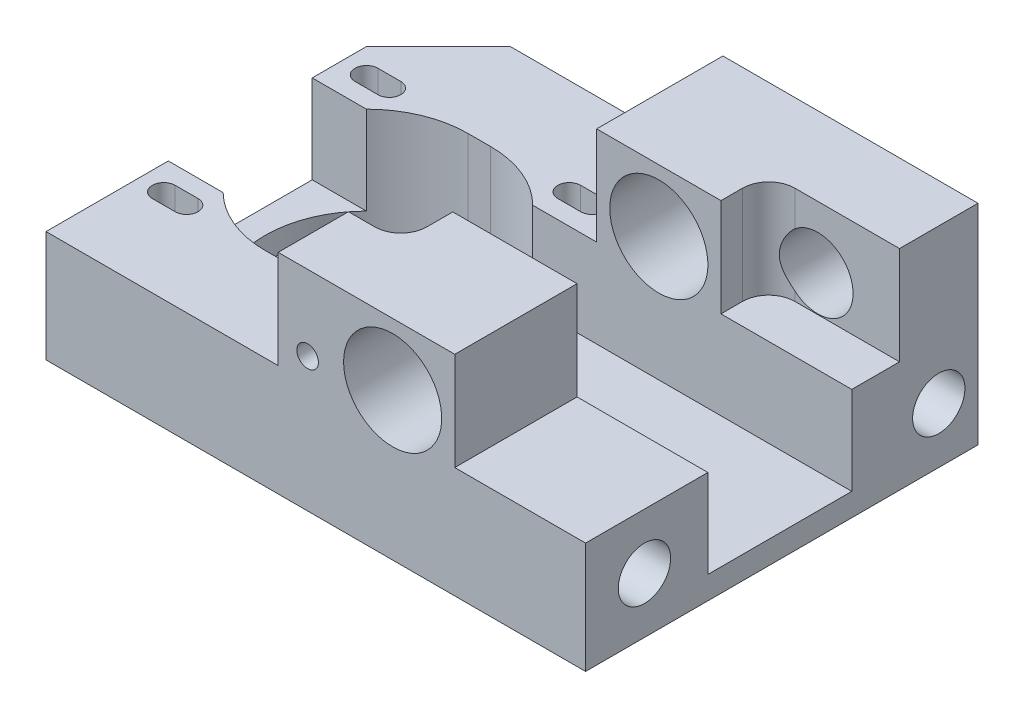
from build123d import *

# Parameters (mm, degrees)
BOSS_EXTRU_1_DEPTH             = 32
ENL_V_MAT_EXTRU_1_DEPTH        = 15
ESQUISSE3_R                    = 7.5
ENL_V_MAT_EXTRU_2_DEPTH        = 107.912347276
TROU_TARAUD_M12X1_251_D        = 10.8
TROU_TARAUD_M41_D              = 3.3
TROUS_DE_CENTRAGE_8_0MM1_D     = 8
TROUS_DE_CENTRAGE_8_0MM1_DEPTH = 39
TROUS_DE_CENTRAGE_8_0MM1_TIP   = 2.403442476
ESQUISSE10_W                   = 22
ESQUISSE10_H                   = 32.48548524
ENL_V_MAT_EXTRU_3_DEPTH        = 107.912347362


with BuildPart() as part:
    # Esquisse1 → Boss.-Extru.1 (new body)
    with BuildSketch(Plane(origin=(0, 0, 0), x_dir=(1, 0, 0), z_dir=(0, 1, 0))):
        Polygon((0, 0), (0, 49), (11, 60), (82.5, 60), (82.5, 0), align=None)
        with BuildLine():
            Line((34.75, 47), (38.25, 47))
            ThreePointArc((38.25, 47), (40, 45.25), (38.25, 43.5))
            Line((38.25, 43.5), (34.75, 43.5))
            ThreePointArc((34.75, 43.5), (33, 45.25), (34.75, 47))
        make_face(mode=Mode.SUBTRACT)
        with BuildLine():
            Line((3.75, 47), (7.25, 47))
            ThreePointArc((7.25, 47), (9, 45.25), (7.25, 43.5))
            Line((7.25, 43.5), (3.75, 43.5))
            ThreePointArc((3.75, 43.5), (2, 45.25), (3.75, 47))
        make_face(mode=Mode.SUBTRACT)
        with BuildLine():
            Line((34.75, 16), (38.25, 16))
            ThreePointArc((38.25, 16), (40, 14.25), (38.25, 12.5))
            Line((38.25, 12.5), (34.75, 12.5))
            ThreePointArc((34.75, 12.5), (33, 14.25), (34.75, 16))
        make_face(mode=Mode.SUBTRACT)
        with BuildLine():
            Line((3.75, 16), (7.25, 16))
            ThreePointArc((7.25, 16), (9, 14.25), (7.25, 12.5))
            Line((7.25, 12.5), (3.75, 12.5))
            ThreePointArc((3.75, 12.5), (2, 14.25), (3.75, 16))
        make_face(mode=Mode.SUBTRACT)
        with BuildLine():
            Line((19.25, 45.25), (22.75, 45.25))
            ThreePointArc((22.75, 45.25), (38.25, 29.75), (22.75, 14.25))
            Line((22.75, 14.25), (19.25, 14.25))
            ThreePointArc((19.25, 14.25), (3.75, 29.75), (19.25, 45.25))
        make_face(mode=Mode.SUBTRACT)
    extrude(amount=BOSS_EXTRU_1_DEPTH)

    # Esquisse2 → Enl_v. mat.-Extru.1 (cut)
    with BuildSketch(Plane(origin=(0, 32, 0), x_dir=(1, 0, 0), z_dir=(0, 1, 0))):
        with BuildLine():
            Line((0, 49), (11, 60))
            Line((11, 60), (43.5, 60))
            Line((43.5, 60), (43.5, 14.75))
            ThreePointArc((43.5, 14.75), (42.328427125, 11.921572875), (39.5, 10.75))
            Line((39.5, 10.75), (35.5, 10.75))
            Line((35.5, 10.75), (35.5, 0))
            Line((35.5, 0), (0, 0))
            Line((0, 0), (0, 49))
        make_face()
        with BuildLine():
            Line((66.5, 48), (82.5, 48))
            Line((82.5, 48), (82.5, 0))
            Line((82.5, 0), (62.5, 0))
            Line((62.5, 0), (62.5, 44))
            ThreePointArc((62.5, 44), (63.671572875, 46.828427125), (66.5, 48))
        make_face()
    extrude(amount=-ENL_V_MAT_EXTRU_1_DEPTH, mode=Mode.SUBTRACT)

    # Esquisse3 → Enl_v. mat.-Extru.2 (cut, through all)
    with BuildSketch(Plane(origin=(0, 0, -60), x_dir=(-1, 0, 0), z_dir=(0, 0, -1))):
        with Locations((-53, 22.5)):
            Circle(ESQUISSE3_R)
    extrude(amount=-ENL_V_MAT_EXTRU_2_DEPTH, mode=Mode.SUBTRACT)

    # Trou taraud_ M12x1.251 (through all)
    with Locations(Plane(origin=(0, 0, -60), x_dir=(-1, 0, 0), z_dir=(0, 0, -1))):
        with Locations((-70, 22.5)):
            Hole(TROU_TARAUD_M12X1_251_D / 2)

    # Trou taraud_ M41 (through all)
    with Locations(Plane.XY):
        with Locations((40, 20.5)):
            Hole(TROU_TARAUD_M41_D / 2)

    # Trous de centrage _8.0mm1
    with Locations(Plane(origin=(82.5, 0, 0), x_dir=(0, 0, -1), z_dir=(1, 0, 0))):
        with Locations((9, 8.5), (54, 8.5)):
            Hole(TROUS_DE_CENTRAGE_8_0MM1_D / 2, depth=TROUS_DE_CENTRAGE_8_0MM1_DEPTH)
            with Locations((0, 0, -(TROUS_DE_CENTRAGE_8_0MM1_DEPTH + TROUS_DE_CENTRAGE_8_0MM1_TIP / 2))):  # 118° drill point
                Cone(0, TROUS_DE_CENTRAGE_8_0MM1_D / 2, TROUS_DE_CENTRAGE_8_0MM1_TIP, mode=Mode.SUBTRACT)

    # Esquisse10 → Enl_v. mat.-Extru.3 (cut, through all)
    with BuildSketch(Plane(origin=(82.5, 0, 0), x_dir=(0, 0, -1), z_dir=(1, 0, 0))):
        with Locations((29.7, 19.74274262)):
            Rectangle(ESQUISSE10_W, ESQUISSE10_H)
    extrude(amount=-ENL_V_MAT_EXTRU_3_DEPTH, mode=Mode.SUBTRACT)


solid = part.part
